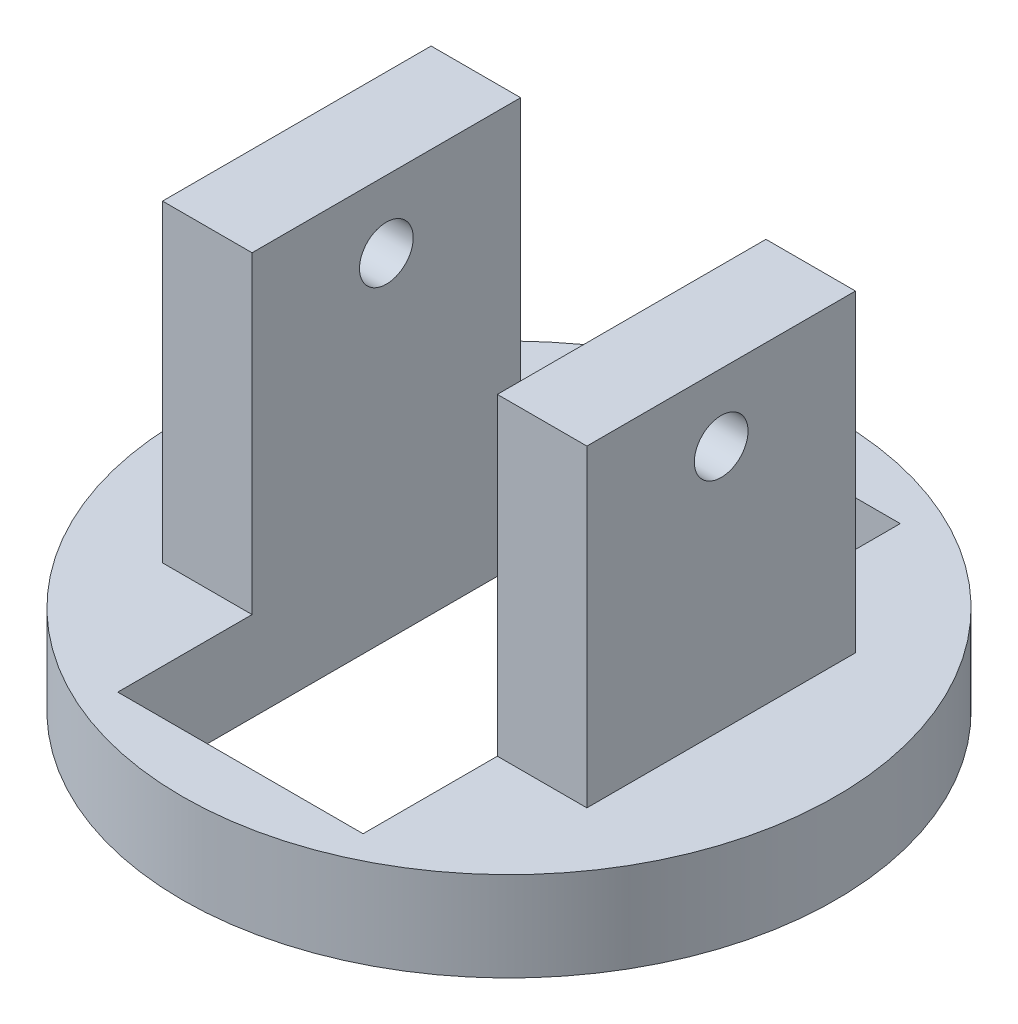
ISO-10303-21;
HEADER;
FILE_DESCRIPTION(('STEP AP214'),'2;1');
FILE_NAME('part.step','',(''),(''),'','','');
FILE_SCHEMA(('AUTOMOTIVE_DESIGN { 1 0 10303 214 1 1 1 1 }'));
ENDSEC;
DATA;
#1=APPLICATION_CONTEXT('core data for automotive mechanical design processes');
#2=APPLICATION_PROTOCOL_DEFINITION('international standard','automotive_design',2000,#1);
#3=PRODUCT_CONTEXT('',#1,'mechanical');
#4=PRODUCT('Part','Part','',(#3));
#5=PRODUCT_RELATED_PRODUCT_CATEGORY('part','',(#4));
#6=PRODUCT_DEFINITION_FORMATION('','',#4);
#7=PRODUCT_DEFINITION_CONTEXT('part definition',#1,'design');
#8=PRODUCT_DEFINITION('design','',#6,#7);
#9=PRODUCT_DEFINITION_SHAPE('','',#8);
#10=(LENGTH_UNIT() NAMED_UNIT(*) SI_UNIT(.MILLI.,.METRE.));
#11=(NAMED_UNIT(*) PLANE_ANGLE_UNIT() SI_UNIT($,.RADIAN.));
#12=(NAMED_UNIT(*) SI_UNIT($,.STERADIAN.) SOLID_ANGLE_UNIT());
#13=UNCERTAINTY_MEASURE_WITH_UNIT(LENGTH_MEASURE(1.E-05),#10,'distance_accuracy_value','');
#14=(GEOMETRIC_REPRESENTATION_CONTEXT(3) GLOBAL_UNCERTAINTY_ASSIGNED_CONTEXT((#13)) GLOBAL_UNIT_ASSIGNED_CONTEXT((#10,
#11,#12)) REPRESENTATION_CONTEXT('',''));
#15=CARTESIAN_POINT('',(0.,0.,0.));
#16=DIRECTION('',(0.,0.,1.));
#17=DIRECTION('',(1.,0.,0.));
#18=AXIS2_PLACEMENT_3D('',#15,#16,#17);
#19=CARTESIAN_POINT('',(0.,10.,0.));
#20=DIRECTION('',(0.,1.,0.));
#21=DIRECTION('',(0.,0.,1.));
#22=AXIS2_PLACEMENT_3D('',#19,#20,#21);
#23=PLANE('',#22);
#24=DIRECTION('',(0.,0.,-1.));
#25=VECTOR('',#24,1.);
#26=CARTESIAN_POINT('',(13.7,10.,-30.));
#27=LINE('',#26,#25);
#28=CARTESIAN_POINT('',(13.7,10.,30.));
#29=VERTEX_POINT('',#28);
#30=CARTESIAN_POINT('',(13.7,10.,15.));
#31=VERTEX_POINT('',#30);
#32=EDGE_CURVE('E140',#29,#31,#27,.T.);
#33=ORIENTED_EDGE('',*,*,#32,.F.);
#34=DIRECTION('',(1.,0.,0.));
#35=VECTOR('',#34,1.);
#36=CARTESIAN_POINT('',(-13.7,10.,30.));
#37=LINE('',#36,#35);
#38=CARTESIAN_POINT('',(-13.7,10.,30.));
#39=VERTEX_POINT('',#38);
#40=EDGE_CURVE('E127',#39,#29,#37,.T.);
#41=ORIENTED_EDGE('',*,*,#40,.F.);
#42=DIRECTION('',(0.,0.,1.));
#43=VECTOR('',#42,1.);
#44=CARTESIAN_POINT('',(-13.7,10.,-30.));
#45=LINE('',#44,#43);
#46=CARTESIAN_POINT('',(-13.7,10.,15.));
#47=VERTEX_POINT('',#46);
#48=EDGE_CURVE('E143',#47,#39,#45,.T.);
#49=ORIENTED_EDGE('',*,*,#48,.F.);
#50=DIRECTION('',(1.,0.,0.));
#51=VECTOR('',#50,1.);
#52=CARTESIAN_POINT('',(-23.7,10.,15.));
#53=LINE('',#52,#51);
#54=CARTESIAN_POINT('',(-23.7,10.,15.));
#55=VERTEX_POINT('',#54);
#56=EDGE_CURVE('E200',#55,#47,#53,.T.);
#57=ORIENTED_EDGE('',*,*,#56,.F.);
#58=DIRECTION('',(0.,0.,1.));
#59=VECTOR('',#58,1.);
#60=CARTESIAN_POINT('',(-23.7,10.,-15.));
#61=LINE('',#60,#59);
#62=CARTESIAN_POINT('',(-23.7,10.,-15.));
#63=VERTEX_POINT('',#62);
#64=EDGE_CURVE('E179',#63,#55,#61,.T.);
#65=ORIENTED_EDGE('',*,*,#64,.F.);
#66=DIRECTION('',(-1.,0.,0.));
#67=VECTOR('',#66,1.);
#68=CARTESIAN_POINT('',(-23.7,10.,-15.));
#69=LINE('',#68,#67);
#70=CARTESIAN_POINT('',(-13.7,10.,-15.));
#71=VERTEX_POINT('',#70);
#72=EDGE_CURVE('E189',#71,#63,#69,.T.);
#73=ORIENTED_EDGE('',*,*,#72,.F.);
#74=CARTESIAN_POINT('',(-13.7,10.,-30.));
#75=VERTEX_POINT('',#74);
#76=EDGE_CURVE('E135',#75,#71,#45,.T.);
#77=ORIENTED_EDGE('',*,*,#76,.F.);
#78=DIRECTION('',(-1.,0.,0.));
#79=VECTOR('',#78,1.);
#80=CARTESIAN_POINT('',(-13.7,10.,-30.));
#81=LINE('',#80,#79);
#82=CARTESIAN_POINT('',(13.7,10.,-30.));
#83=VERTEX_POINT('',#82);
#84=EDGE_CURVE('E136',#83,#75,#81,.T.);
#85=ORIENTED_EDGE('',*,*,#84,.F.);
#86=CARTESIAN_POINT('',(13.7,10.,-15.));
#87=VERTEX_POINT('',#86);
#88=EDGE_CURVE('E111',#87,#83,#27,.T.);
#89=ORIENTED_EDGE('',*,*,#88,.F.);
#90=DIRECTION('',(-1.,0.,0.));
#91=VECTOR('',#90,1.);
#92=CARTESIAN_POINT('',(13.7,10.,-15.));
#93=LINE('',#92,#91);
#94=CARTESIAN_POINT('',(23.7,10.,-15.));
#95=VERTEX_POINT('',#94);
#96=EDGE_CURVE('E171',#95,#87,#93,.T.);
#97=ORIENTED_EDGE('',*,*,#96,.F.);
#98=DIRECTION('',(0.,0.,-1.));
#99=VECTOR('',#98,1.);
#100=CARTESIAN_POINT('',(23.7,10.,-15.));
#101=LINE('',#100,#99);
#102=CARTESIAN_POINT('',(23.7,10.,15.));
#103=VERTEX_POINT('',#102);
#104=EDGE_CURVE('E174',#103,#95,#101,.T.);
#105=ORIENTED_EDGE('',*,*,#104,.F.);
#106=DIRECTION('',(1.,0.,0.));
#107=VECTOR('',#106,1.);
#108=CARTESIAN_POINT('',(13.7,10.,15.));
#109=LINE('',#108,#107);
#110=EDGE_CURVE('E177',#31,#103,#109,.T.);
#111=ORIENTED_EDGE('',*,*,#110,.F.);
#112=EDGE_LOOP('',(#33,#41,#49,#57,#65,#73,#77,#85,#89,#97,#105,#111));
#113=FACE_BOUND('',#112,.T.);
#114=CARTESIAN_POINT('',(0.,10.,0.));
#115=DIRECTION('',(0.,1.,0.));
#116=DIRECTION('',(0.,0.,1.));
#117=AXIS2_PLACEMENT_3D('',#114,#115,#116);
#118=CIRCLE('',#117,36.5);
#119=CARTESIAN_POINT('',(0.,10.,36.5));
#120=VERTEX_POINT('',#119);
#121=EDGE_CURVE('E11',#120,#120,#118,.T.);
#122=ORIENTED_EDGE('',*,*,#121,.T.);
#123=EDGE_LOOP('',(#122));
#124=FACE_BOUND('',#123,.T.);
#125=ADVANCED_FACE('F16',(#113,#124),#23,.T.);
#126=CARTESIAN_POINT('',(0.,10.,0.));
#127=DIRECTION('',(0.,-1.,0.));
#128=DIRECTION('',(0.,0.,-1.));
#129=AXIS2_PLACEMENT_3D('',#126,#127,#128);
#130=CYLINDRICAL_SURFACE('',#129,36.5);
#131=ORIENTED_EDGE('',*,*,#121,.F.);
#132=EDGE_LOOP('',(#131));
#133=FACE_BOUND('',#132,.T.);
#134=CARTESIAN_POINT('',(0.,0.,0.));
#135=DIRECTION('',(0.,1.,0.));
#136=DIRECTION('',(0.,0.,1.));
#137=AXIS2_PLACEMENT_3D('',#134,#135,#136);
#138=CIRCLE('',#137,36.5);
#139=CARTESIAN_POINT('',(0.,0.,36.5));
#140=VERTEX_POINT('',#139);
#141=EDGE_CURVE('E20',#140,#140,#138,.T.);
#142=ORIENTED_EDGE('',*,*,#141,.T.);
#143=EDGE_LOOP('',(#142));
#144=FACE_BOUND('',#143,.T.);
#145=ADVANCED_FACE('F18',(#133,#144),#130,.T.);
#146=CARTESIAN_POINT('',(0.,0.,0.));
#147=DIRECTION('',(0.,1.,0.));
#148=DIRECTION('',(0.,0.,1.));
#149=AXIS2_PLACEMENT_3D('',#146,#147,#148);
#150=PLANE('',#149);
#151=DIRECTION('',(1.,0.,0.));
#152=VECTOR('',#151,1.);
#153=CARTESIAN_POINT('',(-13.7,0.,30.));
#154=LINE('',#153,#152);
#155=CARTESIAN_POINT('',(-13.7,0.,30.));
#156=VERTEX_POINT('',#155);
#157=CARTESIAN_POINT('',(13.7,0.,30.));
#158=VERTEX_POINT('',#157);
#159=EDGE_CURVE('E118',#156,#158,#154,.T.);
#160=ORIENTED_EDGE('',*,*,#159,.T.);
#161=DIRECTION('',(0.,0.,-1.));
#162=VECTOR('',#161,1.);
#163=CARTESIAN_POINT('',(13.7,0.,-30.));
#164=LINE('',#163,#162);
#165=CARTESIAN_POINT('',(13.7,0.,-30.));
#166=VERTEX_POINT('',#165);
#167=EDGE_CURVE('E115',#158,#166,#164,.T.);
#168=ORIENTED_EDGE('',*,*,#167,.T.);
#169=DIRECTION('',(-1.,0.,0.));
#170=VECTOR('',#169,1.);
#171=CARTESIAN_POINT('',(-13.7,0.,-30.));
#172=LINE('',#171,#170);
#173=CARTESIAN_POINT('',(-13.7,0.,-30.));
#174=VERTEX_POINT('',#173);
#175=EDGE_CURVE('E125',#166,#174,#172,.T.);
#176=ORIENTED_EDGE('',*,*,#175,.T.);
#177=DIRECTION('',(0.,0.,1.));
#178=VECTOR('',#177,1.);
#179=CARTESIAN_POINT('',(-13.7,0.,-30.));
#180=LINE('',#179,#178);
#181=EDGE_CURVE('E33',#174,#156,#180,.T.);
#182=ORIENTED_EDGE('',*,*,#181,.T.);
#183=EDGE_LOOP('',(#160,#168,#176,#182));
#184=FACE_BOUND('',#183,.T.);
#185=ORIENTED_EDGE('',*,*,#141,.F.);
#186=EDGE_LOOP('',(#185));
#187=FACE_BOUND('',#186,.T.);
#188=ADVANCED_FACE('F130',(#184,#187),#150,.F.);
#189=CARTESIAN_POINT('',(-23.7,45.,-15.));
#190=DIRECTION('',(1.,0.,0.));
#191=DIRECTION('',(0.,0.,-1.));
#192=AXIS2_PLACEMENT_3D('',#189,#190,#191);
#193=PLANE('',#192);
#194=CARTESIAN_POINT('',(-23.7,37.46,0.));
#195=DIRECTION('',(1.,0.,0.));
#196=DIRECTION('',(0.,0.,-1.));
#197=AXIS2_PLACEMENT_3D('',#194,#195,#196);
#198=CIRCLE('',#197,3.);
#199=CARTESIAN_POINT('',(-23.7,37.46,-3.));
#200=VERTEX_POINT('',#199);
#201=EDGE_CURVE('E158',#200,#200,#198,.T.);
#202=ORIENTED_EDGE('',*,*,#201,.T.);
#203=EDGE_LOOP('',(#202));
#204=FACE_BOUND('',#203,.T.);
#205=ORIENTED_EDGE('',*,*,#64,.T.);
#206=DIRECTION('',(0.,-1.,0.));
#207=VECTOR('',#206,1.);
#208=CARTESIAN_POINT('',(-23.7,45.,15.));
#209=LINE('',#208,#207);
#210=CARTESIAN_POINT('',(-23.7,45.,15.));
#211=VERTEX_POINT('',#210);
#212=EDGE_CURVE('E211',#211,#55,#209,.T.);
#213=ORIENTED_EDGE('',*,*,#212,.F.);
#214=DIRECTION('',(0.,0.,1.));
#215=VECTOR('',#214,1.);
#216=CARTESIAN_POINT('',(-23.7,45.,-15.));
#217=LINE('',#216,#215);
#218=CARTESIAN_POINT('',(-23.7,45.,-15.));
#219=VERTEX_POINT('',#218);
#220=EDGE_CURVE('E186',#219,#211,#217,.T.);
#221=ORIENTED_EDGE('',*,*,#220,.F.);
#222=DIRECTION('',(0.,-1.,0.));
#223=VECTOR('',#222,1.);
#224=CARTESIAN_POINT('',(-23.7,45.,-15.));
#225=LINE('',#224,#223);
#226=EDGE_CURVE('E198',#219,#63,#225,.T.);
#227=ORIENTED_EDGE('',*,*,#226,.T.);
#228=EDGE_LOOP('',(#205,#213,#221,#227));
#229=FACE_BOUND('',#228,.T.);
#230=ADVANCED_FACE('F217',(#204,#229),#193,.F.);
#231=CARTESIAN_POINT('',(-23.7,45.,15.));
#232=DIRECTION('',(0.,0.,-1.));
#233=DIRECTION('',(-1.,0.,0.));
#234=AXIS2_PLACEMENT_3D('',#231,#232,#233);
#235=PLANE('',#234);
#236=ORIENTED_EDGE('',*,*,#56,.T.);
#237=DIRECTION('',(0.,-1.,0.));
#238=VECTOR('',#237,1.);
#239=CARTESIAN_POINT('',(-13.7,45.,15.));
#240=LINE('',#239,#238);
#241=CARTESIAN_POINT('',(-13.7,45.,15.));
#242=VERTEX_POINT('',#241);
#243=EDGE_CURVE('E208',#242,#47,#240,.T.);
#244=ORIENTED_EDGE('',*,*,#243,.F.);
#245=DIRECTION('',(1.,0.,0.));
#246=VECTOR('',#245,1.);
#247=CARTESIAN_POINT('',(-23.7,45.,15.));
#248=LINE('',#247,#246);
#249=EDGE_CURVE('E188',#211,#242,#248,.T.);
#250=ORIENTED_EDGE('',*,*,#249,.F.);
#251=ORIENTED_EDGE('',*,*,#212,.T.);
#252=EDGE_LOOP('',(#236,#244,#250,#251));
#253=FACE_BOUND('',#252,.T.);
#254=ADVANCED_FACE('F223',(#253),#235,.F.);
#255=CARTESIAN_POINT('',(-13.7,45.,-15.));
#256=DIRECTION('',(-1.,0.,0.));
#257=DIRECTION('',(0.,0.,1.));
#258=AXIS2_PLACEMENT_3D('',#255,#256,#257);
#259=PLANE('',#258);
#260=CARTESIAN_POINT('',(-13.7,37.46,0.));
#261=DIRECTION('',(-1.,0.,0.));
#262=DIRECTION('',(0.,0.,1.));
#263=AXIS2_PLACEMENT_3D('',#260,#261,#262);
#264=CIRCLE('',#263,3.);
#265=CARTESIAN_POINT('',(-13.7,37.46,3.));
#266=VERTEX_POINT('',#265);
#267=EDGE_CURVE('E154',#266,#266,#264,.T.);
#268=ORIENTED_EDGE('',*,*,#267,.T.);
#269=EDGE_LOOP('',(#268));
#270=FACE_BOUND('',#269,.T.);
#271=ORIENTED_EDGE('',*,*,#243,.T.);
#272=ORIENTED_EDGE('',*,*,#48,.T.);
#273=DIRECTION('',(0.,1.,0.));
#274=VECTOR('',#273,1.);
#275=CARTESIAN_POINT('',(-13.7,0.,30.));
#276=LINE('',#275,#274);
#277=EDGE_CURVE('E148',#156,#39,#276,.T.);
#278=ORIENTED_EDGE('',*,*,#277,.F.);
#279=ORIENTED_EDGE('',*,*,#181,.F.);
#280=DIRECTION('',(0.,1.,0.));
#281=VECTOR('',#280,1.);
#282=CARTESIAN_POINT('',(-13.7,0.,-30.));
#283=LINE('',#282,#281);
#284=EDGE_CURVE('E119',#174,#75,#283,.T.);
#285=ORIENTED_EDGE('',*,*,#284,.T.);
#286=ORIENTED_EDGE('',*,*,#76,.T.);
#287=DIRECTION('',(0.,-1.,0.));
#288=VECTOR('',#287,1.);
#289=CARTESIAN_POINT('',(-13.7,45.,-15.));
#290=LINE('',#289,#288);
#291=CARTESIAN_POINT('',(-13.7,45.,-15.));
#292=VERTEX_POINT('',#291);
#293=EDGE_CURVE('E202',#292,#71,#290,.T.);
#294=ORIENTED_EDGE('',*,*,#293,.F.);
#295=DIRECTION('',(0.,0.,-1.));
#296=VECTOR('',#295,1.);
#297=CARTESIAN_POINT('',(-13.7,45.,-15.));
#298=LINE('',#297,#296);
#299=EDGE_CURVE('E195',#242,#292,#298,.T.);
#300=ORIENTED_EDGE('',*,*,#299,.F.);
#301=EDGE_LOOP('',(#271,#272,#278,#279,#285,#286,#294,#300));
#302=FACE_BOUND('',#301,.T.);
#303=ADVANCED_FACE('F239',(#270,#302),#259,.F.);
#304=CARTESIAN_POINT('',(-23.7,45.,-15.));
#305=DIRECTION('',(0.,0.,1.));
#306=DIRECTION('',(1.,0.,0.));
#307=AXIS2_PLACEMENT_3D('',#304,#305,#306);
#308=PLANE('',#307);
#309=ORIENTED_EDGE('',*,*,#72,.T.);
#310=ORIENTED_EDGE('',*,*,#226,.F.);
#311=DIRECTION('',(-1.,0.,0.));
#312=VECTOR('',#311,1.);
#313=CARTESIAN_POINT('',(-23.7,45.,-15.));
#314=LINE('',#313,#312);
#315=EDGE_CURVE('E191',#292,#219,#314,.T.);
#316=ORIENTED_EDGE('',*,*,#315,.F.);
#317=ORIENTED_EDGE('',*,*,#293,.T.);
#318=EDGE_LOOP('',(#309,#310,#316,#317));
#319=FACE_BOUND('',#318,.T.);
#320=ADVANCED_FACE('F242',(#319),#308,.F.);
#321=CARTESIAN_POINT('',(0.,45.,0.));
#322=DIRECTION('',(0.,1.,0.));
#323=DIRECTION('',(0.,0.,1.));
#324=AXIS2_PLACEMENT_3D('',#321,#322,#323);
#325=PLANE('',#324);
#326=ORIENTED_EDGE('',*,*,#220,.T.);
#327=ORIENTED_EDGE('',*,*,#249,.T.);
#328=ORIENTED_EDGE('',*,*,#299,.T.);
#329=ORIENTED_EDGE('',*,*,#315,.T.);
#330=EDGE_LOOP('',(#326,#327,#328,#329));
#331=FACE_BOUND('',#330,.T.);
#332=ADVANCED_FACE('F250',(#331),#325,.T.);
#333=CARTESIAN_POINT('',(13.7,45.,-15.));
#334=DIRECTION('',(1.,0.,0.));
#335=DIRECTION('',(0.,0.,-1.));
#336=AXIS2_PLACEMENT_3D('',#333,#334,#335);
#337=PLANE('',#336);
#338=CARTESIAN_POINT('',(13.7,37.46,0.));
#339=DIRECTION('',(1.,0.,0.));
#340=DIRECTION('',(0.,0.,-1.));
#341=AXIS2_PLACEMENT_3D('',#338,#339,#340);
#342=CIRCLE('',#341,3.);
#343=CARTESIAN_POINT('',(13.7,37.46,-3.));
#344=VERTEX_POINT('',#343);
#345=EDGE_CURVE('E155',#344,#344,#342,.T.);
#346=ORIENTED_EDGE('',*,*,#345,.T.);
#347=EDGE_LOOP('',(#346));
#348=FACE_BOUND('',#347,.T.);
#349=DIRECTION('',(0.,-1.,0.));
#350=VECTOR('',#349,1.);
#351=CARTESIAN_POINT('',(13.7,45.,-15.));
#352=LINE('',#351,#350);
#353=CARTESIAN_POINT('',(13.7,45.,-15.));
#354=VERTEX_POINT('',#353);
#355=EDGE_CURVE('E169',#354,#87,#352,.T.);
#356=ORIENTED_EDGE('',*,*,#355,.T.);
#357=ORIENTED_EDGE('',*,*,#88,.T.);
#358=DIRECTION('',(0.,1.,0.));
#359=VECTOR('',#358,1.);
#360=CARTESIAN_POINT('',(13.7,0.,-30.));
#361=LINE('',#360,#359);
#362=EDGE_CURVE('E110',#166,#83,#361,.T.);
#363=ORIENTED_EDGE('',*,*,#362,.F.);
#364=ORIENTED_EDGE('',*,*,#167,.F.);
#365=DIRECTION('',(0.,1.,0.));
#366=VECTOR('',#365,1.);
#367=CARTESIAN_POINT('',(13.7,0.,30.));
#368=LINE('',#367,#366);
#369=EDGE_CURVE('E141',#158,#29,#368,.T.);
#370=ORIENTED_EDGE('',*,*,#369,.T.);
#371=ORIENTED_EDGE('',*,*,#32,.T.);
#372=DIRECTION('',(0.,-1.,0.));
#373=VECTOR('',#372,1.);
#374=CARTESIAN_POINT('',(13.7,45.,15.));
#375=LINE('',#374,#373);
#376=CARTESIAN_POINT('',(13.7,45.,15.));
#377=VERTEX_POINT('',#376);
#378=EDGE_CURVE('E161',#377,#31,#375,.T.);
#379=ORIENTED_EDGE('',*,*,#378,.F.);
#380=DIRECTION('',(0.,0.,1.));
#381=VECTOR('',#380,1.);
#382=CARTESIAN_POINT('',(13.7,45.,-15.));
#383=LINE('',#382,#381);
#384=EDGE_CURVE('E173',#354,#377,#383,.T.);
#385=ORIENTED_EDGE('',*,*,#384,.F.);
#386=EDGE_LOOP('',(#356,#357,#363,#364,#370,#371,#379,#385));
#387=FACE_BOUND('',#386,.T.);
#388=ADVANCED_FACE('F109',(#348,#387),#337,.F.);
#389=CARTESIAN_POINT('',(13.7,45.,15.));
#390=DIRECTION('',(0.,0.,-1.));
#391=DIRECTION('',(-1.,0.,0.));
#392=AXIS2_PLACEMENT_3D('',#389,#390,#391);
#393=PLANE('',#392);
#394=ORIENTED_EDGE('',*,*,#110,.T.);
#395=DIRECTION('',(0.,-1.,0.));
#396=VECTOR('',#395,1.);
#397=CARTESIAN_POINT('',(23.7,45.,15.));
#398=LINE('',#397,#396);
#399=CARTESIAN_POINT('',(23.7,45.,15.));
#400=VERTEX_POINT('',#399);
#401=EDGE_CURVE('E163',#400,#103,#398,.T.);
#402=ORIENTED_EDGE('',*,*,#401,.F.);
#403=DIRECTION('',(1.,0.,0.));
#404=VECTOR('',#403,1.);
#405=CARTESIAN_POINT('',(13.7,45.,15.));
#406=LINE('',#405,#404);
#407=EDGE_CURVE('E181',#377,#400,#406,.T.);
#408=ORIENTED_EDGE('',*,*,#407,.F.);
#409=ORIENTED_EDGE('',*,*,#378,.T.);
#410=EDGE_LOOP('',(#394,#402,#408,#409));
#411=FACE_BOUND('',#410,.T.);
#412=ADVANCED_FACE('F263',(#411),#393,.F.);
#413=CARTESIAN_POINT('',(23.7,45.,-15.));
#414=DIRECTION('',(-1.,0.,0.));
#415=DIRECTION('',(0.,0.,1.));
#416=AXIS2_PLACEMENT_3D('',#413,#414,#415);
#417=PLANE('',#416);
#418=CARTESIAN_POINT('',(23.7,37.46,0.));
#419=DIRECTION('',(1.,0.,0.));
#420=DIRECTION('',(0.,0.,-1.));
#421=AXIS2_PLACEMENT_3D('',#418,#419,#420);
#422=CIRCLE('',#421,3.);
#423=CARTESIAN_POINT('',(23.7,37.46,-3.));
#424=VERTEX_POINT('',#423);
#425=EDGE_CURVE('E144',#424,#424,#422,.T.);
#426=ORIENTED_EDGE('',*,*,#425,.F.);
#427=EDGE_LOOP('',(#426));
#428=FACE_BOUND('',#427,.T.);
#429=ORIENTED_EDGE('',*,*,#104,.T.);
#430=DIRECTION('',(0.,-1.,0.));
#431=VECTOR('',#430,1.);
#432=CARTESIAN_POINT('',(23.7,45.,-15.));
#433=LINE('',#432,#431);
#434=CARTESIAN_POINT('',(23.7,45.,-15.));
#435=VERTEX_POINT('',#434);
#436=EDGE_CURVE('E39',#435,#95,#433,.T.);
#437=ORIENTED_EDGE('',*,*,#436,.F.);
#438=DIRECTION('',(0.,0.,-1.));
#439=VECTOR('',#438,1.);
#440=CARTESIAN_POINT('',(23.7,45.,-15.));
#441=LINE('',#440,#439);
#442=EDGE_CURVE('E178',#400,#435,#441,.T.);
#443=ORIENTED_EDGE('',*,*,#442,.F.);
#444=ORIENTED_EDGE('',*,*,#401,.T.);
#445=EDGE_LOOP('',(#429,#437,#443,#444));
#446=FACE_BOUND('',#445,.T.);
#447=ADVANCED_FACE('F257',(#428,#446),#417,.F.);
#448=CARTESIAN_POINT('',(13.7,45.,-15.));
#449=DIRECTION('',(0.,0.,1.));
#450=DIRECTION('',(1.,0.,0.));
#451=AXIS2_PLACEMENT_3D('',#448,#449,#450);
#452=PLANE('',#451);
#453=ORIENTED_EDGE('',*,*,#96,.T.);
#454=ORIENTED_EDGE('',*,*,#355,.F.);
#455=DIRECTION('',(-1.,0.,0.));
#456=VECTOR('',#455,1.);
#457=CARTESIAN_POINT('',(13.7,45.,-15.));
#458=LINE('',#457,#456);
#459=EDGE_CURVE('E168',#435,#354,#458,.T.);
#460=ORIENTED_EDGE('',*,*,#459,.F.);
#461=ORIENTED_EDGE('',*,*,#436,.T.);
#462=EDGE_LOOP('',(#453,#454,#460,#461));
#463=FACE_BOUND('',#462,.T.);
#464=ADVANCED_FACE('F258',(#463),#452,.F.);
#465=CARTESIAN_POINT('',(0.,45.,0.));
#466=DIRECTION('',(0.,1.,0.));
#467=DIRECTION('',(0.,0.,1.));
#468=AXIS2_PLACEMENT_3D('',#465,#466,#467);
#469=PLANE('',#468);
#470=ORIENTED_EDGE('',*,*,#384,.T.);
#471=ORIENTED_EDGE('',*,*,#407,.T.);
#472=ORIENTED_EDGE('',*,*,#442,.T.);
#473=ORIENTED_EDGE('',*,*,#459,.T.);
#474=EDGE_LOOP('',(#470,#471,#472,#473));
#475=FACE_BOUND('',#474,.T.);
#476=ADVANCED_FACE('F252',(#475),#469,.T.);
#477=CARTESIAN_POINT('',(-36.5,37.46,0.));
#478=DIRECTION('',(1.,0.,0.));
#479=DIRECTION('',(0.,0.,-1.));
#480=AXIS2_PLACEMENT_3D('',#477,#478,#479);
#481=CYLINDRICAL_SURFACE('',#480,3.);
#482=ORIENTED_EDGE('',*,*,#425,.T.);
#483=EDGE_LOOP('',(#482));
#484=FACE_BOUND('',#483,.T.);
#485=ORIENTED_EDGE('',*,*,#345,.F.);
#486=EDGE_LOOP('',(#485));
#487=FACE_BOUND('',#486,.T.);
#488=ADVANCED_FACE('F254',(#484,#487),#481,.F.);
#489=ORIENTED_EDGE('',*,*,#267,.F.);
#490=EDGE_LOOP('',(#489));
#491=FACE_BOUND('',#490,.T.);
#492=ORIENTED_EDGE('',*,*,#201,.F.);
#493=EDGE_LOOP('',(#492));
#494=FACE_BOUND('',#493,.T.);
#495=ADVANCED_FACE('F271',(#491,#494),#481,.F.);
#496=CARTESIAN_POINT('',(-13.7,0.,30.));
#497=DIRECTION('',(0.,0.,1.));
#498=DIRECTION('',(1.,0.,0.));
#499=AXIS2_PLACEMENT_3D('',#496,#497,#498);
#500=PLANE('',#499);
#501=ORIENTED_EDGE('',*,*,#40,.T.);
#502=ORIENTED_EDGE('',*,*,#369,.F.);
#503=ORIENTED_EDGE('',*,*,#159,.F.);
#504=ORIENTED_EDGE('',*,*,#277,.T.);
#505=EDGE_LOOP('',(#501,#502,#503,#504));
#506=FACE_BOUND('',#505,.T.);
#507=ADVANCED_FACE('F273',(#506),#500,.F.);
#508=CARTESIAN_POINT('',(-13.7,0.,-30.));
#509=DIRECTION('',(0.,0.,-1.));
#510=DIRECTION('',(-1.,0.,0.));
#511=AXIS2_PLACEMENT_3D('',#508,#509,#510);
#512=PLANE('',#511);
#513=ORIENTED_EDGE('',*,*,#84,.T.);
#514=ORIENTED_EDGE('',*,*,#284,.F.);
#515=ORIENTED_EDGE('',*,*,#175,.F.);
#516=ORIENTED_EDGE('',*,*,#362,.T.);
#517=EDGE_LOOP('',(#513,#514,#515,#516));
#518=FACE_BOUND('',#517,.T.);
#519=ADVANCED_FACE('F124',(#518),#512,.F.);
#520=CLOSED_SHELL('',(#125,#145,#188,#230,#254,#303,#320,#332,#388,#412,#447,#464,#476,#488,
#495,#507,#519));
#521=MANIFOLD_SOLID_BREP('B1',#520);
#522=ADVANCED_BREP_SHAPE_REPRESENTATION('',(#18,#521),#14);
#523=SHAPE_DEFINITION_REPRESENTATION(#9,#522);
ENDSEC;
END-ISO-10303-21;
